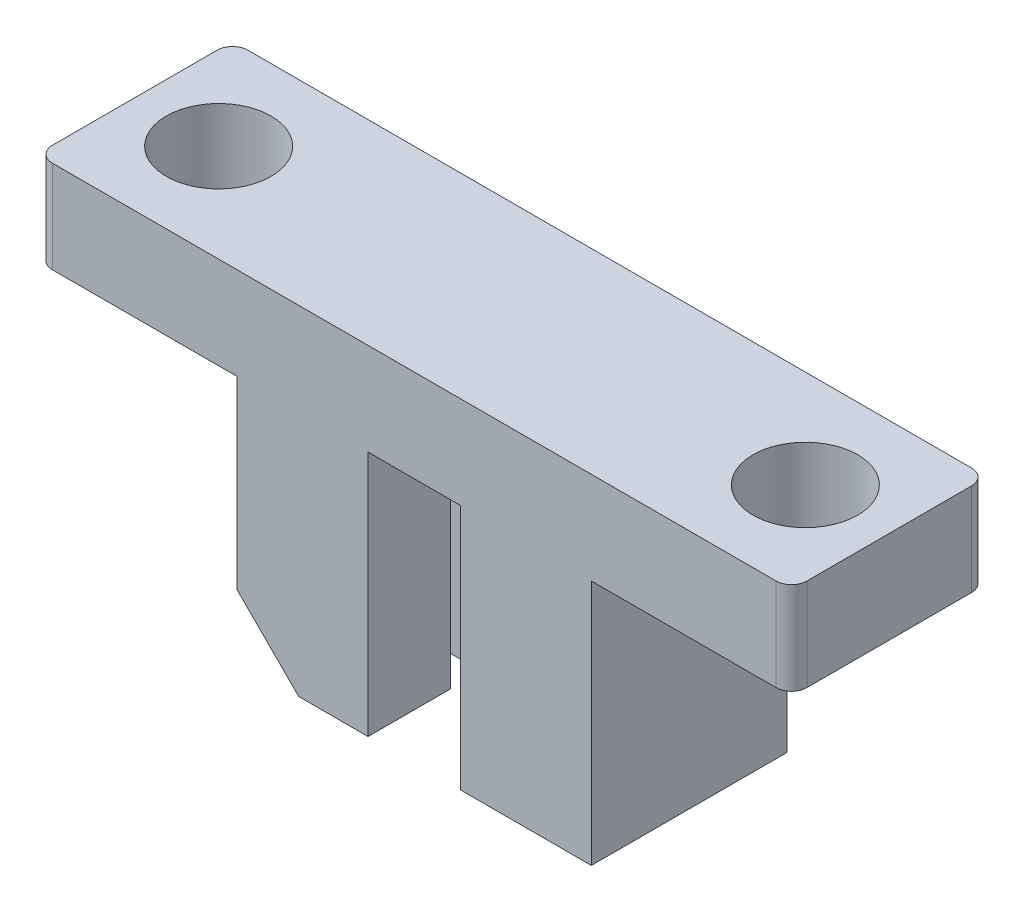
from build123d import *

# Parameters (mm, degrees)
BOSS_EXTRU_1_DEPTH      = 3.175
ESQUISSE2_W             = 5.35
ESQUISSE2_H             = 1
ENL_V_MAT_EXTRU_1_DEPTH = 5.5
D_GAGEMENT_M31_D        = 3.4
CONG_1_R                = 0.5


with BuildPart() as part:
    # Esquisse1 → Boss.-Extru.1 (new, symmetric)
    with BuildSketch(Plane.XY):
        Polygon((-12.25, 0), (12.25, 0), (12.25, -3), (5.75, -3), (5.75, -11), (1.5, -11), (1.5, -3), (-1.5, -3), (-1.5, -11), (-3.75, -11), (-5.75, -9), (-5.75, -3), (-12.25, -3), align=None)
    extrude(amount=BOSS_EXTRU_1_DEPTH, both=True)

    # Esquisse2 → Enl_v. mat.-Extru.1 (cut)
    with BuildSketch(Plane.XZ.offset(11)):
        Rectangle(ESQUISSE2_W, ESQUISSE2_H)
    extrude(amount=-ENL_V_MAT_EXTRU_1_DEPTH, mode=Mode.SUBTRACT)

    # D_gagement M31 (through all)
    with Locations(Plane(origin=(0, -3, 0), x_dir=(-1, 0, 0), z_dir=(0, -1, 0))):
        with Locations((9.525, 0), (-9.525, 0)):
            Hole(D_GAGEMENT_M31_D / 2)

    # Cong_1
    cong_1_edges = [part.edges().sort_by_distance(p)[0] for p in [
        (12.25, -1.5, -3.175),
        (-12.25, -1.5, -3.175),
        (12.25, -1.5, 3.175),
        (-12.25, -1.5, 3.175),
    ]]
    fillet(cong_1_edges, radius=CONG_1_R)


solid = part.part
